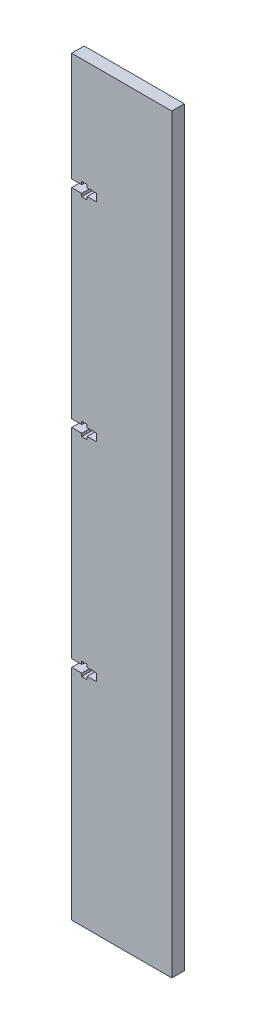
ISO-10303-21;
HEADER;
FILE_DESCRIPTION(('STEP AP214'),'2;1');
FILE_NAME('part.step','',(''),(''),'','','');
FILE_SCHEMA(('AUTOMOTIVE_DESIGN { 1 0 10303 214 1 1 1 1 }'));
ENDSEC;
DATA;
#1=APPLICATION_CONTEXT('core data for automotive mechanical design processes');
#2=APPLICATION_PROTOCOL_DEFINITION('international standard','automotive_design',2000,#1);
#3=PRODUCT_CONTEXT('',#1,'mechanical');
#4=PRODUCT('Part','Part','',(#3));
#5=PRODUCT_RELATED_PRODUCT_CATEGORY('part','',(#4));
#6=PRODUCT_DEFINITION_FORMATION('','',#4);
#7=PRODUCT_DEFINITION_CONTEXT('part definition',#1,'design');
#8=PRODUCT_DEFINITION('design','',#6,#7);
#9=PRODUCT_DEFINITION_SHAPE('','',#8);
#10=(LENGTH_UNIT() NAMED_UNIT(*) SI_UNIT(.MILLI.,.METRE.));
#11=(NAMED_UNIT(*) PLANE_ANGLE_UNIT() SI_UNIT($,.RADIAN.));
#12=(NAMED_UNIT(*) SI_UNIT($,.STERADIAN.) SOLID_ANGLE_UNIT());
#13=UNCERTAINTY_MEASURE_WITH_UNIT(LENGTH_MEASURE(1.E-05),#10,'distance_accuracy_value','');
#14=(GEOMETRIC_REPRESENTATION_CONTEXT(3) GLOBAL_UNCERTAINTY_ASSIGNED_CONTEXT((#13)) GLOBAL_UNIT_ASSIGNED_CONTEXT((#10,
#11,#12)) REPRESENTATION_CONTEXT('',''));
#15=CARTESIAN_POINT('',(0.,0.,0.));
#16=DIRECTION('',(0.,0.,1.));
#17=DIRECTION('',(1.,0.,0.));
#18=AXIS2_PLACEMENT_3D('',#15,#16,#17);
#19=CARTESIAN_POINT('',(-20.,150.,5.));
#20=DIRECTION('',(1.,0.,0.));
#21=DIRECTION('',(0.,1.,0.));
#22=AXIS2_PLACEMENT_3D('',#19,#20,#21);
#23=PLANE('',#22);
#24=DIRECTION('',(0.,-1.,0.));
#25=VECTOR('',#24,1.);
#26=CARTESIAN_POINT('',(-20.,150.,0.));
#27=LINE('',#26,#25);
#28=CARTESIAN_POINT('',(-20.,103.499999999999,0.));
#29=VERTEX_POINT('',#28);
#30=CARTESIAN_POINT('',(-20.,23.4999999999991,0.));
#31=VERTEX_POINT('',#30);
#32=EDGE_CURVE('E316',#29,#31,#27,.T.);
#33=ORIENTED_EDGE('',*,*,#32,.T.);
#34=DIRECTION('',(0.,0.,-1.));
#35=VECTOR('',#34,1.);
#36=CARTESIAN_POINT('',(-20.,23.4999999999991,10.));
#37=LINE('',#36,#35);
#38=CARTESIAN_POINT('',(-20.,23.4999999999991,5.));
#39=VERTEX_POINT('',#38);
#40=EDGE_CURVE('E308',#39,#31,#37,.T.);
#41=ORIENTED_EDGE('',*,*,#40,.F.);
#42=DIRECTION('',(0.,-1.,0.));
#43=VECTOR('',#42,1.);
#44=CARTESIAN_POINT('',(-20.,150.,5.));
#45=LINE('',#44,#43);
#46=CARTESIAN_POINT('',(-20.,103.499999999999,5.));
#47=VERTEX_POINT('',#46);
#48=EDGE_CURVE('E539',#47,#39,#45,.T.);
#49=ORIENTED_EDGE('',*,*,#48,.F.);
#50=DIRECTION('',(0.,0.,-1.));
#51=VECTOR('',#50,1.);
#52=CARTESIAN_POINT('',(-20.,103.499999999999,10.));
#53=LINE('',#52,#51);
#54=EDGE_CURVE('E408',#47,#29,#53,.T.);
#55=ORIENTED_EDGE('',*,*,#54,.T.);
#56=EDGE_LOOP('',(#33,#41,#49,#55));
#57=FACE_BOUND('',#56,.T.);
#58=ADVANCED_FACE('F33',(#57),#23,.F.);
#59=CARTESIAN_POINT('',(-20.,150.,0.));
#60=VERTEX_POINT('',#59);
#61=CARTESIAN_POINT('',(-20.,106.499999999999,0.));
#62=VERTEX_POINT('',#61);
#63=EDGE_CURVE('E319',#60,#62,#27,.T.);
#64=ORIENTED_EDGE('',*,*,#63,.T.);
#65=DIRECTION('',(0.,0.,-1.));
#66=VECTOR('',#65,1.);
#67=CARTESIAN_POINT('',(-20.,106.499999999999,10.));
#68=LINE('',#67,#66);
#69=CARTESIAN_POINT('',(-20.,106.499999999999,5.));
#70=VERTEX_POINT('',#69);
#71=EDGE_CURVE('E406',#70,#62,#68,.T.);
#72=ORIENTED_EDGE('',*,*,#71,.F.);
#73=CARTESIAN_POINT('',(-20.,150.,5.));
#74=VERTEX_POINT('',#73);
#75=EDGE_CURVE('E348',#74,#70,#45,.T.);
#76=ORIENTED_EDGE('',*,*,#75,.F.);
#77=DIRECTION('',(0.,0.,-1.));
#78=VECTOR('',#77,1.);
#79=CARTESIAN_POINT('',(-20.,150.,5.));
#80=LINE('',#79,#78);
#81=EDGE_CURVE('E41',#74,#60,#80,.T.);
#82=ORIENTED_EDGE('',*,*,#81,.T.);
#83=EDGE_LOOP('',(#64,#72,#76,#82));
#84=FACE_BOUND('',#83,.T.);
#85=ADVANCED_FACE('F346',(#84),#23,.F.);
#86=CARTESIAN_POINT('',(-20.,20.5000000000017,5.));
#87=VERTEX_POINT('',#86);
#88=CARTESIAN_POINT('',(-20.,-59.4999999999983,5.));
#89=VERTEX_POINT('',#88);
#90=EDGE_CURVE('E307',#87,#89,#45,.T.);
#91=ORIENTED_EDGE('',*,*,#90,.F.);
#92=DIRECTION('',(0.,0.,-1.));
#93=VECTOR('',#92,1.);
#94=CARTESIAN_POINT('',(-20.,20.5000000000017,10.));
#95=LINE('',#94,#93);
#96=CARTESIAN_POINT('',(-20.,20.5000000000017,0.));
#97=VERTEX_POINT('',#96);
#98=EDGE_CURVE('E294',#87,#97,#95,.T.);
#99=ORIENTED_EDGE('',*,*,#98,.T.);
#100=CARTESIAN_POINT('',(-20.,-59.4999999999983,0.));
#101=VERTEX_POINT('',#100);
#102=EDGE_CURVE('E305',#97,#101,#27,.T.);
#103=ORIENTED_EDGE('',*,*,#102,.T.);
#104=DIRECTION('',(0.,0.,-1.));
#105=VECTOR('',#104,1.);
#106=CARTESIAN_POINT('',(-20.,-59.4999999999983,10.));
#107=LINE('',#106,#105);
#108=EDGE_CURVE('E506',#89,#101,#107,.T.);
#109=ORIENTED_EDGE('',*,*,#108,.F.);
#110=EDGE_LOOP('',(#91,#99,#103,#109));
#111=FACE_BOUND('',#110,.T.);
#112=ADVANCED_FACE('F303',(#111),#23,.F.);
#113=CARTESIAN_POINT('',(20.,150.,5.));
#114=DIRECTION('',(-1.,0.,0.));
#115=DIRECTION('',(0.,-1.,0.));
#116=AXIS2_PLACEMENT_3D('',#113,#114,#115);
#117=PLANE('',#116);
#118=DIRECTION('',(0.,1.,0.));
#119=VECTOR('',#118,1.);
#120=CARTESIAN_POINT('',(20.,150.,0.));
#121=LINE('',#120,#119);
#122=CARTESIAN_POINT('',(20.,-150.,0.));
#123=VERTEX_POINT('',#122);
#124=CARTESIAN_POINT('',(20.,150.,0.));
#125=VERTEX_POINT('',#124);
#126=EDGE_CURVE('E534',#123,#125,#121,.T.);
#127=ORIENTED_EDGE('',*,*,#126,.T.);
#128=DIRECTION('',(0.,0.,-1.));
#129=VECTOR('',#128,1.);
#130=CARTESIAN_POINT('',(20.,150.,5.));
#131=LINE('',#130,#129);
#132=CARTESIAN_POINT('',(20.,150.,5.));
#133=VERTEX_POINT('',#132);
#134=EDGE_CURVE('E11',#133,#125,#131,.T.);
#135=ORIENTED_EDGE('',*,*,#134,.F.);
#136=DIRECTION('',(0.,1.,0.));
#137=VECTOR('',#136,1.);
#138=CARTESIAN_POINT('',(20.,150.,5.));
#139=LINE('',#138,#137);
#140=CARTESIAN_POINT('',(20.,-150.,5.));
#141=VERTEX_POINT('',#140);
#142=EDGE_CURVE('E330',#141,#133,#139,.T.);
#143=ORIENTED_EDGE('',*,*,#142,.F.);
#144=DIRECTION('',(0.,0.,-1.));
#145=VECTOR('',#144,1.);
#146=CARTESIAN_POINT('',(20.,-150.,5.));
#147=LINE('',#146,#145);
#148=EDGE_CURVE('E340',#141,#123,#147,.T.);
#149=ORIENTED_EDGE('',*,*,#148,.T.);
#150=EDGE_LOOP('',(#127,#135,#143,#149));
#151=FACE_BOUND('',#150,.T.);
#152=ADVANCED_FACE('F35',(#151),#117,.F.);
#153=CARTESIAN_POINT('',(-20.,150.,5.));
#154=DIRECTION('',(0.,-1.,0.));
#155=DIRECTION('',(0.,0.,-1.));
#156=AXIS2_PLACEMENT_3D('',#153,#154,#155);
#157=PLANE('',#156);
#158=DIRECTION('',(-1.,0.,0.));
#159=VECTOR('',#158,1.);
#160=CARTESIAN_POINT('',(-20.,150.,0.));
#161=LINE('',#160,#159);
#162=EDGE_CURVE('E321',#125,#60,#161,.T.);
#163=ORIENTED_EDGE('',*,*,#162,.T.);
#164=ORIENTED_EDGE('',*,*,#81,.F.);
#165=DIRECTION('',(-1.,0.,0.));
#166=VECTOR('',#165,1.);
#167=CARTESIAN_POINT('',(-20.,150.,5.));
#168=LINE('',#167,#166);
#169=EDGE_CURVE('E337',#133,#74,#168,.T.);
#170=ORIENTED_EDGE('',*,*,#169,.F.);
#171=ORIENTED_EDGE('',*,*,#134,.T.);
#172=EDGE_LOOP('',(#163,#164,#170,#171));
#173=FACE_BOUND('',#172,.T.);
#174=ADVANCED_FACE('F542',(#173),#157,.F.);
#175=CARTESIAN_POINT('',(-20.,-62.4999999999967,5.));
#176=VERTEX_POINT('',#175);
#177=CARTESIAN_POINT('',(-20.,-150.,5.));
#178=VERTEX_POINT('',#177);
#179=EDGE_CURVE('E537',#176,#178,#45,.T.);
#180=ORIENTED_EDGE('',*,*,#179,.F.);
#181=DIRECTION('',(0.,0.,-1.));
#182=VECTOR('',#181,1.);
#183=CARTESIAN_POINT('',(-20.,-62.4999999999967,10.));
#184=LINE('',#183,#182);
#185=CARTESIAN_POINT('',(-20.,-62.4999999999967,0.));
#186=VERTEX_POINT('',#185);
#187=EDGE_CURVE('E508',#176,#186,#184,.T.);
#188=ORIENTED_EDGE('',*,*,#187,.T.);
#189=CARTESIAN_POINT('',(-20.,-150.,0.));
#190=VERTEX_POINT('',#189);
#191=EDGE_CURVE('E317',#186,#190,#27,.T.);
#192=ORIENTED_EDGE('',*,*,#191,.T.);
#193=DIRECTION('',(0.,0.,-1.));
#194=VECTOR('',#193,1.);
#195=CARTESIAN_POINT('',(-20.,-150.,5.));
#196=LINE('',#195,#194);
#197=EDGE_CURVE('E342',#178,#190,#196,.T.);
#198=ORIENTED_EDGE('',*,*,#197,.F.);
#199=EDGE_LOOP('',(#180,#188,#192,#198));
#200=FACE_BOUND('',#199,.T.);
#201=ADVANCED_FACE('F552',(#200),#23,.F.);
#202=CARTESIAN_POINT('',(-20.,-150.,5.));
#203=DIRECTION('',(0.,1.,0.));
#204=DIRECTION('',(0.,0.,1.));
#205=AXIS2_PLACEMENT_3D('',#202,#203,#204);
#206=PLANE('',#205);
#207=DIRECTION('',(1.,0.,0.));
#208=VECTOR('',#207,1.);
#209=CARTESIAN_POINT('',(-20.,-150.,0.));
#210=LINE('',#209,#208);
#211=EDGE_CURVE('E325',#190,#123,#210,.T.);
#212=ORIENTED_EDGE('',*,*,#211,.T.);
#213=ORIENTED_EDGE('',*,*,#148,.F.);
#214=DIRECTION('',(1.,0.,0.));
#215=VECTOR('',#214,1.);
#216=CARTESIAN_POINT('',(-20.,-150.,5.));
#217=LINE('',#216,#215);
#218=EDGE_CURVE('E343',#178,#141,#217,.T.);
#219=ORIENTED_EDGE('',*,*,#218,.F.);
#220=ORIENTED_EDGE('',*,*,#197,.T.);
#221=EDGE_LOOP('',(#212,#213,#219,#220));
#222=FACE_BOUND('',#221,.T.);
#223=ADVANCED_FACE('F554',(#222),#206,.F.);
#224=CARTESIAN_POINT('',(0.,0.,5.));
#225=DIRECTION('',(0.,0.,1.));
#226=DIRECTION('',(1.,0.,0.));
#227=AXIS2_PLACEMENT_3D('',#224,#225,#226);
#228=PLANE('',#227);
#229=DIRECTION('',(-1.,0.,0.));
#230=VECTOR('',#229,1.);
#231=CARTESIAN_POINT('',(0.,23.4999999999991,5.));
#232=LINE('',#231,#230);
#233=CARTESIAN_POINT('',(-15.9999999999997,23.4999999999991,5.));
#234=VERTEX_POINT('',#233);
#235=EDGE_CURVE('E437',#234,#39,#232,.T.);
#236=ORIENTED_EDGE('',*,*,#235,.F.);
#237=DIRECTION('',(3.07724860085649E-13,-1.,0.));
#238=VECTOR('',#237,1.);
#239=CARTESIAN_POINT('',(-15.9999999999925,-4.92359776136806E-12,5.));
#240=LINE('',#239,#238);
#241=CARTESIAN_POINT('',(-16.,24.6500000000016,5.));
#242=VERTEX_POINT('',#241);
#243=EDGE_CURVE('E439',#242,#234,#240,.T.);
#244=ORIENTED_EDGE('',*,*,#243,.F.);
#245=DIRECTION('',(-1.,0.,0.));
#246=VECTOR('',#245,1.);
#247=CARTESIAN_POINT('',(1.16620728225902E-13,24.6500000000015,5.));
#248=LINE('',#247,#246);
#249=CARTESIAN_POINT('',(-13.8,24.6500000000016,5.));
#250=VERTEX_POINT('',#249);
#251=EDGE_CURVE('E441',#250,#242,#248,.T.);
#252=ORIENTED_EDGE('',*,*,#251,.F.);
#253=DIRECTION('',(-3.06216404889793E-13,1.,0.));
#254=VECTOR('',#253,1.);
#255=CARTESIAN_POINT('',(-13.7999999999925,-4.22578638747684E-12,5.));
#256=LINE('',#255,#254);
#257=CARTESIAN_POINT('',(-13.7999999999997,23.5000000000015,5.));
#258=VERTEX_POINT('',#257);
#259=EDGE_CURVE('E443',#258,#250,#256,.T.);
#260=ORIENTED_EDGE('',*,*,#259,.F.);
#261=DIRECTION('',(-1.,0.,0.));
#262=VECTOR('',#261,1.);
#263=CARTESIAN_POINT('',(0.,23.5000000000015,5.));
#264=LINE('',#263,#262);
#265=CARTESIAN_POINT('',(-9.99999999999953,23.5000000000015,5.));
#266=VERTEX_POINT('',#265);
#267=EDGE_CURVE('E445',#266,#258,#264,.T.);
#268=ORIENTED_EDGE('',*,*,#267,.F.);
#269=DIRECTION('',(-3.05889572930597E-13,1.,0.));
#270=VECTOR('',#269,1.);
#271=CARTESIAN_POINT('',(-9.99999999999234,-3.05889572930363E-12,5.));
#272=LINE('',#271,#270);
#273=CARTESIAN_POINT('',(-9.99999999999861,20.5000000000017,5.));
#274=VERTEX_POINT('',#273);
#275=EDGE_CURVE('E447',#274,#266,#272,.T.);
#276=ORIENTED_EDGE('',*,*,#275,.F.);
#277=DIRECTION('',(1.,0.,0.));
#278=VECTOR('',#277,1.);
#279=CARTESIAN_POINT('',(0.,20.5000000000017,5.));
#280=LINE('',#279,#278);
#281=CARTESIAN_POINT('',(-13.7999999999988,20.5000000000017,5.));
#282=VERTEX_POINT('',#281);
#283=EDGE_CURVE('E449',#282,#274,#280,.T.);
#284=ORIENTED_EDGE('',*,*,#283,.F.);
#285=DIRECTION('',(-3.06216404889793E-13,1.,0.));
#286=VECTOR('',#285,1.);
#287=CARTESIAN_POINT('',(-13.7999999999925,-4.22578638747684E-12,5.));
#288=LINE('',#287,#286);
#289=CARTESIAN_POINT('',(-13.7999999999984,19.3500000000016,5.));
#290=VERTEX_POINT('',#289);
#291=EDGE_CURVE('E451',#290,#282,#288,.T.);
#292=ORIENTED_EDGE('',*,*,#291,.F.);
#293=DIRECTION('',(1.,0.,0.));
#294=VECTOR('',#293,1.);
#295=CARTESIAN_POINT('',(0.,19.3500000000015,5.));
#296=LINE('',#295,#294);
#297=CARTESIAN_POINT('',(-15.9999999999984,19.3500000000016,5.));
#298=VERTEX_POINT('',#297);
#299=EDGE_CURVE('E453',#298,#290,#296,.T.);
#300=ORIENTED_EDGE('',*,*,#299,.F.);
#301=DIRECTION('',(3.04707949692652E-13,-1.,0.));
#302=VECTOR('',#301,1.);
#303=CARTESIAN_POINT('',(-15.9999999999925,-4.87532719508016E-12,5.));
#304=LINE('',#303,#302);
#305=CARTESIAN_POINT('',(-15.9999999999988,20.5000000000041,5.));
#306=VERTEX_POINT('',#305);
#307=EDGE_CURVE('E455',#306,#298,#304,.T.);
#308=ORIENTED_EDGE('',*,*,#307,.F.);
#309=DIRECTION('',(1.,1.20650017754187E-12,0.));
#310=VECTOR('',#309,1.);
#311=CARTESIAN_POINT('',(-2.47332536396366E-11,20.5000000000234,5.));
#312=LINE('',#311,#310);
#313=EDGE_CURVE('E435',#87,#306,#312,.T.);
#314=ORIENTED_EDGE('',*,*,#313,.F.);
#315=ORIENTED_EDGE('',*,*,#90,.T.);
#316=DIRECTION('',(-1.,-1.20736753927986E-12,0.));
#317=VECTOR('',#316,1.);
#318=CARTESIAN_POINT('',(7.18383685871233E-11,-59.4999999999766,5.));
#319=LINE('',#318,#317);
#320=CARTESIAN_POINT('',(-15.9999999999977,-59.4999999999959,5.));
#321=VERTEX_POINT('',#320);
#322=EDGE_CURVE('E514',#321,#89,#319,.T.);
#323=ORIENTED_EDGE('',*,*,#322,.F.);
#324=DIRECTION('',(8.59819462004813E-13,-1.,0.));
#325=VECTOR('',#324,1.);
#326=CARTESIAN_POINT('',(-16.0000000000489,-1.3757111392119E-11,5.));
#327=LINE('',#326,#325);
#328=CARTESIAN_POINT('',(-15.9999999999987,-58.3499999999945,5.));
#329=VERTEX_POINT('',#328);
#330=EDGE_CURVE('E517',#329,#321,#327,.T.);
#331=ORIENTED_EDGE('',*,*,#330,.F.);
#332=DIRECTION('',(-1.,-8.38975353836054E-13,0.));
#333=VECTOR('',#332,1.);
#334=CARTESIAN_POINT('',(4.89542118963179E-11,-58.349999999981,5.));
#335=LINE('',#334,#333);
#336=CARTESIAN_POINT('',(-13.7999999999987,-58.3499999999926,5.));
#337=VERTEX_POINT('',#336);
#338=EDGE_CURVE('E519',#337,#329,#335,.T.);
#339=ORIENTED_EDGE('',*,*,#338,.F.);
#340=DIRECTION('',(-8.5680255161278E-13,1.,0.));
#341=VECTOR('',#340,1.);
#342=CARTESIAN_POINT('',(-13.8000000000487,-1.18238752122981E-11,5.));
#343=LINE('',#342,#341);
#344=CARTESIAN_POINT('',(-13.7999999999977,-59.4999999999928,5.));
#345=VERTEX_POINT('',#344);
#346=EDGE_CURVE('E521',#345,#337,#343,.T.);
#347=ORIENTED_EDGE('',*,*,#346,.F.);
#348=DIRECTION('',(-1.,0.,0.));
#349=VECTOR('',#348,1.);
#350=CARTESIAN_POINT('',(-4.34593881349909E-13,-59.4999999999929,5.));
#351=LINE('',#350,#349);
#352=CARTESIAN_POINT('',(-9.99999999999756,-59.4999999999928,5.));
#353=VERTEX_POINT('',#352);
#354=EDGE_CURVE('E523',#353,#345,#351,.T.);
#355=ORIENTED_EDGE('',*,*,#354,.F.);
#356=DIRECTION('',(-8.57531638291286E-13,1.,0.));
#357=VECTOR('',#356,1.);
#358=CARTESIAN_POINT('',(-10.0000000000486,-8.57531638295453E-12,5.));
#359=LINE('',#358,#357);
#360=CARTESIAN_POINT('',(-9.99999999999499,-62.4999999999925,5.));
#361=VERTEX_POINT('',#360);
#362=EDGE_CURVE('E525',#361,#353,#359,.T.);
#363=ORIENTED_EDGE('',*,*,#362,.F.);
#364=DIRECTION('',(1.,0.,0.));
#365=VECTOR('',#364,1.);
#366=CARTESIAN_POINT('',(-4.5650617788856E-13,-62.4999999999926,5.));
#367=LINE('',#366,#365);
#368=CARTESIAN_POINT('',(-13.7999999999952,-62.4999999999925,5.));
#369=VERTEX_POINT('',#368);
#370=EDGE_CURVE('E527',#369,#361,#367,.T.);
#371=ORIENTED_EDGE('',*,*,#370,.F.);
#372=DIRECTION('',(-8.5680255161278E-13,1.,0.));
#373=VECTOR('',#372,1.);
#374=CARTESIAN_POINT('',(-13.8000000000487,-1.18238752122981E-11,5.));
#375=LINE('',#374,#373);
#376=CARTESIAN_POINT('',(-13.7999999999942,-63.6499999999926,5.));
#377=VERTEX_POINT('',#376);
#378=EDGE_CURVE('E529',#377,#369,#375,.T.);
#379=ORIENTED_EDGE('',*,*,#378,.F.);
#380=DIRECTION('',(1.,8.38975353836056E-13,0.));
#381=VECTOR('',#380,1.);
#382=CARTESIAN_POINT('',(5.34007812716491E-11,-63.649999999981,5.));
#383=LINE('',#382,#381);
#384=CARTESIAN_POINT('',(-15.9999999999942,-63.6499999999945,5.));
#385=VERTEX_POINT('',#384);
#386=EDGE_CURVE('E531',#385,#377,#383,.T.);
#387=ORIENTED_EDGE('',*,*,#386,.F.);
#388=DIRECTION('',(8.56802551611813E-13,-1.,0.));
#389=VECTOR('',#388,1.);
#390=CARTESIAN_POINT('',(-16.0000000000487,-1.37088408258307E-11,5.));
#391=LINE('',#390,#389);
#392=CARTESIAN_POINT('',(-15.9999999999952,-62.499999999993,5.));
#393=VERTEX_POINT('',#392);
#394=EDGE_CURVE('E533',#393,#385,#391,.T.);
#395=ORIENTED_EDGE('',*,*,#394,.F.);
#396=DIRECTION('',(1.,1.85788884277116E-12,0.));
#397=VECTOR('',#396,1.);
#398=CARTESIAN_POINT('',(1.16118052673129E-10,-62.4999999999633,5.));
#399=LINE('',#398,#397);
#400=EDGE_CURVE('E489',#176,#393,#399,.T.);
#401=ORIENTED_EDGE('',*,*,#400,.F.);
#402=ORIENTED_EDGE('',*,*,#179,.T.);
#403=ORIENTED_EDGE('',*,*,#218,.T.);
#404=ORIENTED_EDGE('',*,*,#142,.T.);
#405=ORIENTED_EDGE('',*,*,#169,.T.);
#406=ORIENTED_EDGE('',*,*,#75,.T.);
#407=DIRECTION('',(-1.,3.95516952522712E-13,0.));
#408=VECTOR('',#407,1.);
#409=CARTESIAN_POINT('',(4.21225554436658E-11,106.499999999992,5.));
#410=LINE('',#409,#408);
#411=CARTESIAN_POINT('',(-16.0000000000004,106.499999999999,5.));
#412=VERTEX_POINT('',#411);
#413=EDGE_CURVE('E414',#412,#70,#410,.T.);
#414=ORIENTED_EDGE('',*,*,#413,.F.);
#415=DIRECTION('',(0.,-1.,0.));
#416=VECTOR('',#415,1.);
#417=CARTESIAN_POINT('',(-16.000000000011,1.59292868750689E-12,5.));
#418=LINE('',#417,#416);
#419=CARTESIAN_POINT('',(-16.0000000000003,107.649999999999,5.));
#420=VERTEX_POINT('',#419);
#421=EDGE_CURVE('E417',#420,#412,#418,.T.);
#422=ORIENTED_EDGE('',*,*,#421,.F.);
#423=DIRECTION('',(-1.,2.01858731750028E-13,0.));
#424=VECTOR('',#423,1.);
#425=CARTESIAN_POINT('',(2.17300924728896E-11,107.649999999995,5.));
#426=LINE('',#425,#424);
#427=CARTESIAN_POINT('',(-13.8000000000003,107.649999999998,5.));
#428=VERTEX_POINT('',#427);
#429=EDGE_CURVE('E419',#428,#420,#426,.T.);
#430=ORIENTED_EDGE('',*,*,#429,.F.);
#431=DIRECTION('',(0.,1.,0.));
#432=VECTOR('',#431,1.);
#433=CARTESIAN_POINT('',(-13.7999999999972,-3.95516952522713E-13,5.));
#434=LINE('',#433,#432);
#435=CARTESIAN_POINT('',(-13.8000000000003,106.499999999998,5.));
#436=VERTEX_POINT('',#435);
#437=EDGE_CURVE('E421',#436,#428,#434,.T.);
#438=ORIENTED_EDGE('',*,*,#437,.F.);
#439=DIRECTION('',(-1.,1.97210668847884E-13,0.));
#440=VECTOR('',#439,1.);
#441=CARTESIAN_POINT('',(2.10029362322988E-11,106.499999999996,5.));
#442=LINE('',#441,#440);
#443=CARTESIAN_POINT('',(-10.0000000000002,106.499999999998,5.));
#444=VERTEX_POINT('',#443);
#445=EDGE_CURVE('E423',#444,#436,#442,.T.);
#446=ORIENTED_EDGE('',*,*,#445,.F.);
#447=DIRECTION('',(0.,1.,0.));
#448=VECTOR('',#447,1.);
#449=CARTESIAN_POINT('',(-10.0000000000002,0.,5.));
#450=LINE('',#449,#448);
#451=CARTESIAN_POINT('',(-10.0000000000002,103.499999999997,5.));
#452=VERTEX_POINT('',#451);
#453=EDGE_CURVE('E425',#452,#444,#450,.T.);
#454=ORIENTED_EDGE('',*,*,#453,.F.);
#455=DIRECTION('',(1.,-1.97210668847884E-13,0.));
#456=VECTOR('',#455,1.);
#457=CARTESIAN_POINT('',(2.04113042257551E-11,103.499999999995,5.));
#458=LINE('',#457,#456);
#459=CARTESIAN_POINT('',(-13.8000000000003,103.499999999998,5.));
#460=VERTEX_POINT('',#459);
#461=EDGE_CURVE('E427',#460,#452,#458,.T.);
#462=ORIENTED_EDGE('',*,*,#461,.F.);
#463=DIRECTION('',(0.,1.,0.));
#464=VECTOR('',#463,1.);
#465=CARTESIAN_POINT('',(-13.8000000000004,0.,5.));
#466=LINE('',#465,#464);
#467=CARTESIAN_POINT('',(-13.8000000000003,102.349999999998,5.));
#468=VERTEX_POINT('',#467);
#469=EDGE_CURVE('E429',#468,#460,#466,.T.);
#470=ORIENTED_EDGE('',*,*,#469,.F.);
#471=DIRECTION('',(1.,-2.01858731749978E-13,0.));
#472=VECTOR('',#471,1.);
#473=CARTESIAN_POINT('',(2.06602411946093E-11,102.349999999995,5.));
#474=LINE('',#473,#472);
#475=CARTESIAN_POINT('',(-16.0000000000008,102.349999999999,5.));
#476=VERTEX_POINT('',#475);
#477=EDGE_CURVE('E431',#476,#468,#474,.T.);
#478=ORIENTED_EDGE('',*,*,#477,.F.);
#479=DIRECTION('',(0.,-1.,0.));
#480=VECTOR('',#479,1.);
#481=CARTESIAN_POINT('',(-16.0000000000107,1.54465812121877E-12,5.));
#482=LINE('',#481,#480);
#483=CARTESIAN_POINT('',(-16.0000000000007,103.499999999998,5.));
#484=VERTEX_POINT('',#483);
#485=EDGE_CURVE('E433',#484,#476,#482,.T.);
#486=ORIENTED_EDGE('',*,*,#485,.F.);
#487=DIRECTION('',(1.,-3.26128013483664E-13,0.));
#488=VECTOR('',#487,1.);
#489=CARTESIAN_POINT('',(3.3754249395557E-11,103.499999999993,5.));
#490=LINE('',#489,#488);
#491=EDGE_CURVE('E412',#47,#484,#490,.T.);
#492=ORIENTED_EDGE('',*,*,#491,.F.);
#493=ORIENTED_EDGE('',*,*,#48,.T.);
#494=EDGE_LOOP('',(#236,#244,#252,#260,#268,#276,#284,#292,#300,#308,#314,#315,#323,#331,#339,
#347,#355,#363,#371,#379,#387,#395,#401,#402,#403,#404,#405,#406,#414,#422,#430,#438,#446,#454,
#462,#470,#478,#486,#492,#493));
#495=FACE_BOUND('',#494,.T.);
#496=ADVANCED_FACE('F557',(#495),#228,.T.);
#497=CARTESIAN_POINT('',(0.,0.,0.));
#498=DIRECTION('',(0.,0.,1.));
#499=DIRECTION('',(1.,0.,0.));
#500=AXIS2_PLACEMENT_3D('',#497,#498,#499);
#501=PLANE('',#500);
#502=DIRECTION('',(-3.07724860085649E-13,1.,0.));
#503=VECTOR('',#502,1.);
#504=CARTESIAN_POINT('',(-15.9999999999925,-4.92359776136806E-12,0.));
#505=LINE('',#504,#503);
#506=CARTESIAN_POINT('',(-15.9999999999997,23.4999999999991,0.));
#507=VERTEX_POINT('',#506);
#508=CARTESIAN_POINT('',(-16.,24.6500000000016,0.));
#509=VERTEX_POINT('',#508);
#510=EDGE_CURVE('E612',#507,#509,#505,.T.);
#511=ORIENTED_EDGE('',*,*,#510,.F.);
#512=DIRECTION('',(1.,0.,0.));
#513=VECTOR('',#512,1.);
#514=CARTESIAN_POINT('',(0.,23.4999999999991,0.));
#515=LINE('',#514,#513);
#516=EDGE_CURVE('E299',#31,#507,#515,.T.);
#517=ORIENTED_EDGE('',*,*,#516,.F.);
#518=ORIENTED_EDGE('',*,*,#32,.F.);
#519=DIRECTION('',(-1.,3.26128013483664E-13,0.));
#520=VECTOR('',#519,1.);
#521=CARTESIAN_POINT('',(3.3754249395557E-11,103.499999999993,0.));
#522=LINE('',#521,#520);
#523=CARTESIAN_POINT('',(-16.0000000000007,103.499999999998,0.));
#524=VERTEX_POINT('',#523);
#525=EDGE_CURVE('E360',#524,#29,#522,.T.);
#526=ORIENTED_EDGE('',*,*,#525,.F.);
#527=DIRECTION('',(0.,1.,0.));
#528=VECTOR('',#527,1.);
#529=CARTESIAN_POINT('',(-16.0000000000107,1.54465812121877E-12,0.));
#530=LINE('',#529,#528);
#531=CARTESIAN_POINT('',(-16.0000000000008,102.349999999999,0.));
#532=VERTEX_POINT('',#531);
#533=EDGE_CURVE('E56',#532,#524,#530,.T.);
#534=ORIENTED_EDGE('',*,*,#533,.F.);
#535=DIRECTION('',(-1.,2.01858731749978E-13,0.));
#536=VECTOR('',#535,1.);
#537=CARTESIAN_POINT('',(2.06602411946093E-11,102.349999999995,0.));
#538=LINE('',#537,#536);
#539=CARTESIAN_POINT('',(-13.8000000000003,102.349999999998,0.));
#540=VERTEX_POINT('',#539);
#541=EDGE_CURVE('E384',#540,#532,#538,.T.);
#542=ORIENTED_EDGE('',*,*,#541,.F.);
#543=DIRECTION('',(0.,-1.,0.));
#544=VECTOR('',#543,1.);
#545=CARTESIAN_POINT('',(-13.8000000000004,0.,0.));
#546=LINE('',#545,#544);
#547=CARTESIAN_POINT('',(-13.8000000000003,103.499999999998,0.));
#548=VERTEX_POINT('',#547);
#549=EDGE_CURVE('E381',#548,#540,#546,.T.);
#550=ORIENTED_EDGE('',*,*,#549,.F.);
#551=DIRECTION('',(-1.,1.97210668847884E-13,0.));
#552=VECTOR('',#551,1.);
#553=CARTESIAN_POINT('',(2.04113042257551E-11,103.499999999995,0.));
#554=LINE('',#553,#552);
#555=CARTESIAN_POINT('',(-10.0000000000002,103.499999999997,0.));
#556=VERTEX_POINT('',#555);
#557=EDGE_CURVE('E378',#556,#548,#554,.T.);
#558=ORIENTED_EDGE('',*,*,#557,.F.);
#559=DIRECTION('',(0.,-1.,0.));
#560=VECTOR('',#559,1.);
#561=CARTESIAN_POINT('',(-10.0000000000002,0.,0.));
#562=LINE('',#561,#560);
#563=CARTESIAN_POINT('',(-10.0000000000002,106.499999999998,0.));
#564=VERTEX_POINT('',#563);
#565=EDGE_CURVE('E375',#564,#556,#562,.T.);
#566=ORIENTED_EDGE('',*,*,#565,.F.);
#567=DIRECTION('',(1.,-1.97210668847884E-13,0.));
#568=VECTOR('',#567,1.);
#569=CARTESIAN_POINT('',(2.10029362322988E-11,106.499999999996,0.));
#570=LINE('',#569,#568);
#571=CARTESIAN_POINT('',(-13.8000000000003,106.499999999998,0.));
#572=VERTEX_POINT('',#571);
#573=EDGE_CURVE('E372',#572,#564,#570,.T.);
#574=ORIENTED_EDGE('',*,*,#573,.F.);
#575=DIRECTION('',(0.,-1.,0.));
#576=VECTOR('',#575,1.);
#577=CARTESIAN_POINT('',(-13.7999999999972,-3.95516952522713E-13,0.));
#578=LINE('',#577,#576);
#579=CARTESIAN_POINT('',(-13.8000000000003,107.649999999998,0.));
#580=VERTEX_POINT('',#579);
#581=EDGE_CURVE('E369',#580,#572,#578,.T.);
#582=ORIENTED_EDGE('',*,*,#581,.F.);
#583=DIRECTION('',(1.,-2.01858731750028E-13,0.));
#584=VECTOR('',#583,1.);
#585=CARTESIAN_POINT('',(2.17300924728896E-11,107.649999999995,0.));
#586=LINE('',#585,#584);
#587=CARTESIAN_POINT('',(-16.0000000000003,107.649999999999,0.));
#588=VERTEX_POINT('',#587);
#589=EDGE_CURVE('E362',#588,#580,#586,.T.);
#590=ORIENTED_EDGE('',*,*,#589,.F.);
#591=DIRECTION('',(0.,1.,0.));
#592=VECTOR('',#591,1.);
#593=CARTESIAN_POINT('',(-16.000000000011,1.59292868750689E-12,0.));
#594=LINE('',#593,#592);
#595=CARTESIAN_POINT('',(-16.0000000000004,106.499999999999,0.));
#596=VERTEX_POINT('',#595);
#597=EDGE_CURVE('E357',#596,#588,#594,.T.);
#598=ORIENTED_EDGE('',*,*,#597,.F.);
#599=DIRECTION('',(1.,-3.95516952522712E-13,0.));
#600=VECTOR('',#599,1.);
#601=CARTESIAN_POINT('',(4.21225554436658E-11,106.499999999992,0.));
#602=LINE('',#601,#600);
#603=EDGE_CURVE('E354',#62,#596,#602,.T.);
#604=ORIENTED_EDGE('',*,*,#603,.F.);
#605=ORIENTED_EDGE('',*,*,#63,.F.);
#606=ORIENTED_EDGE('',*,*,#162,.F.);
#607=ORIENTED_EDGE('',*,*,#126,.F.);
#608=ORIENTED_EDGE('',*,*,#211,.F.);
#609=ORIENTED_EDGE('',*,*,#191,.F.);
#610=DIRECTION('',(-1.,-1.85788884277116E-12,0.));
#611=VECTOR('',#610,1.);
#612=CARTESIAN_POINT('',(1.16118052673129E-10,-62.4999999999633,0.));
#613=LINE('',#612,#611);
#614=CARTESIAN_POINT('',(-15.9999999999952,-62.499999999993,0.));
#615=VERTEX_POINT('',#614);
#616=EDGE_CURVE('E459',#615,#186,#613,.T.);
#617=ORIENTED_EDGE('',*,*,#616,.F.);
#618=DIRECTION('',(-8.56802551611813E-13,1.,0.));
#619=VECTOR('',#618,1.);
#620=CARTESIAN_POINT('',(-16.0000000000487,-1.37088408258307E-11,0.));
#621=LINE('',#620,#619);
#622=CARTESIAN_POINT('',(-15.9999999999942,-63.6499999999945,0.));
#623=VERTEX_POINT('',#622);
#624=EDGE_CURVE('E457',#623,#615,#621,.T.);
#625=ORIENTED_EDGE('',*,*,#624,.F.);
#626=DIRECTION('',(-1.,-8.38975353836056E-13,0.));
#627=VECTOR('',#626,1.);
#628=CARTESIAN_POINT('',(5.34007812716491E-11,-63.649999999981,0.));
#629=LINE('',#628,#627);
#630=CARTESIAN_POINT('',(-13.7999999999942,-63.6499999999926,0.));
#631=VERTEX_POINT('',#630);
#632=EDGE_CURVE('E483',#631,#623,#629,.T.);
#633=ORIENTED_EDGE('',*,*,#632,.F.);
#634=DIRECTION('',(8.5680255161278E-13,-1.,0.));
#635=VECTOR('',#634,1.);
#636=CARTESIAN_POINT('',(-13.8000000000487,-1.18238752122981E-11,0.));
#637=LINE('',#636,#635);
#638=CARTESIAN_POINT('',(-13.7999999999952,-62.4999999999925,0.));
#639=VERTEX_POINT('',#638);
#640=EDGE_CURVE('E480',#639,#631,#637,.T.);
#641=ORIENTED_EDGE('',*,*,#640,.F.);
#642=DIRECTION('',(-1.,0.,0.));
#643=VECTOR('',#642,1.);
#644=CARTESIAN_POINT('',(-4.5650617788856E-13,-62.4999999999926,0.));
#645=LINE('',#644,#643);
#646=CARTESIAN_POINT('',(-9.99999999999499,-62.4999999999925,0.));
#647=VERTEX_POINT('',#646);
#648=EDGE_CURVE('E477',#647,#639,#645,.T.);
#649=ORIENTED_EDGE('',*,*,#648,.F.);
#650=DIRECTION('',(8.57531638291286E-13,-1.,0.));
#651=VECTOR('',#650,1.);
#652=CARTESIAN_POINT('',(-10.0000000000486,-8.57531638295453E-12,0.));
#653=LINE('',#652,#651);
#654=CARTESIAN_POINT('',(-9.99999999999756,-59.4999999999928,0.));
#655=VERTEX_POINT('',#654);
#656=EDGE_CURVE('E474',#655,#647,#653,.T.);
#657=ORIENTED_EDGE('',*,*,#656,.F.);
#658=DIRECTION('',(1.,0.,0.));
#659=VECTOR('',#658,1.);
#660=CARTESIAN_POINT('',(-4.34593881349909E-13,-59.4999999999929,0.));
#661=LINE('',#660,#659);
#662=CARTESIAN_POINT('',(-13.7999999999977,-59.4999999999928,0.));
#663=VERTEX_POINT('',#662);
#664=EDGE_CURVE('E471',#663,#655,#661,.T.);
#665=ORIENTED_EDGE('',*,*,#664,.F.);
#666=DIRECTION('',(8.5680255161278E-13,-1.,0.));
#667=VECTOR('',#666,1.);
#668=CARTESIAN_POINT('',(-13.8000000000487,-1.18238752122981E-11,0.));
#669=LINE('',#668,#667);
#670=CARTESIAN_POINT('',(-13.7999999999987,-58.3499999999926,0.));
#671=VERTEX_POINT('',#670);
#672=EDGE_CURVE('E468',#671,#663,#669,.T.);
#673=ORIENTED_EDGE('',*,*,#672,.F.);
#674=DIRECTION('',(1.,8.38975353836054E-13,0.));
#675=VECTOR('',#674,1.);
#676=CARTESIAN_POINT('',(4.89542118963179E-11,-58.349999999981,0.));
#677=LINE('',#676,#675);
#678=CARTESIAN_POINT('',(-15.9999999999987,-58.3499999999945,0.));
#679=VERTEX_POINT('',#678);
#680=EDGE_CURVE('E465',#679,#671,#677,.T.);
#681=ORIENTED_EDGE('',*,*,#680,.F.);
#682=DIRECTION('',(-8.59819462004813E-13,1.,0.));
#683=VECTOR('',#682,1.);
#684=CARTESIAN_POINT('',(-16.0000000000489,-1.3757111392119E-11,0.));
#685=LINE('',#684,#683);
#686=CARTESIAN_POINT('',(-15.9999999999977,-59.4999999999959,0.));
#687=VERTEX_POINT('',#686);
#688=EDGE_CURVE('E462',#687,#679,#685,.T.);
#689=ORIENTED_EDGE('',*,*,#688,.F.);
#690=DIRECTION('',(1.,1.20736753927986E-12,0.));
#691=VECTOR('',#690,1.);
#692=CARTESIAN_POINT('',(7.18383685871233E-11,-59.4999999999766,0.));
#693=LINE('',#692,#691);
#694=EDGE_CURVE('E315',#101,#687,#693,.T.);
#695=ORIENTED_EDGE('',*,*,#694,.F.);
#696=ORIENTED_EDGE('',*,*,#102,.F.);
#697=DIRECTION('',(-1.,-1.20650017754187E-12,0.));
#698=VECTOR('',#697,1.);
#699=CARTESIAN_POINT('',(-2.47332536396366E-11,20.5000000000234,0.));
#700=LINE('',#699,#698);
#701=CARTESIAN_POINT('',(-15.9999999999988,20.5000000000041,0.));
#702=VERTEX_POINT('',#701);
#703=EDGE_CURVE('E291',#702,#97,#700,.T.);
#704=ORIENTED_EDGE('',*,*,#703,.F.);
#705=DIRECTION('',(-3.04707949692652E-13,1.,0.));
#706=VECTOR('',#705,1.);
#707=CARTESIAN_POINT('',(-15.9999999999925,-4.87532719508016E-12,0.));
#708=LINE('',#707,#706);
#709=CARTESIAN_POINT('',(-15.9999999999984,19.3500000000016,0.));
#710=VERTEX_POINT('',#709);
#711=EDGE_CURVE('E48',#710,#702,#708,.T.);
#712=ORIENTED_EDGE('',*,*,#711,.F.);
#713=DIRECTION('',(-1.,0.,0.));
#714=VECTOR('',#713,1.);
#715=CARTESIAN_POINT('',(0.,19.3500000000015,0.));
#716=LINE('',#715,#714);
#717=CARTESIAN_POINT('',(-13.7999999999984,19.3500000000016,0.));
#718=VERTEX_POINT('',#717);
#719=EDGE_CURVE('E577',#718,#710,#716,.T.);
#720=ORIENTED_EDGE('',*,*,#719,.F.);
#721=DIRECTION('',(3.06216404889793E-13,-1.,0.));
#722=VECTOR('',#721,1.);
#723=CARTESIAN_POINT('',(-13.7999999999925,-4.22578638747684E-12,0.));
#724=LINE('',#723,#722);
#725=CARTESIAN_POINT('',(-13.7999999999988,20.5000000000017,0.));
#726=VERTEX_POINT('',#725);
#727=EDGE_CURVE('E579',#726,#718,#724,.T.);
#728=ORIENTED_EDGE('',*,*,#727,.F.);
#729=DIRECTION('',(-1.,0.,0.));
#730=VECTOR('',#729,1.);
#731=CARTESIAN_POINT('',(0.,20.5000000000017,0.));
#732=LINE('',#731,#730);
#733=CARTESIAN_POINT('',(-9.99999999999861,20.5000000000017,0.));
#734=VERTEX_POINT('',#733);
#735=EDGE_CURVE('E585',#734,#726,#732,.T.);
#736=ORIENTED_EDGE('',*,*,#735,.F.);
#737=DIRECTION('',(3.05889572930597E-13,-1.,0.));
#738=VECTOR('',#737,1.);
#739=CARTESIAN_POINT('',(-9.99999999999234,-3.05889572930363E-12,0.));
#740=LINE('',#739,#738);
#741=CARTESIAN_POINT('',(-9.99999999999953,23.5000000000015,0.));
#742=VERTEX_POINT('',#741);
#743=EDGE_CURVE('E626',#742,#734,#740,.T.);
#744=ORIENTED_EDGE('',*,*,#743,.F.);
#745=DIRECTION('',(1.,0.,0.));
#746=VECTOR('',#745,1.);
#747=CARTESIAN_POINT('',(0.,23.5000000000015,0.));
#748=LINE('',#747,#746);
#749=CARTESIAN_POINT('',(-13.7999999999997,23.5000000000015,0.));
#750=VERTEX_POINT('',#749);
#751=EDGE_CURVE('E620',#750,#742,#748,.T.);
#752=ORIENTED_EDGE('',*,*,#751,.F.);
#753=DIRECTION('',(3.06216404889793E-13,-1.,0.));
#754=VECTOR('',#753,1.);
#755=CARTESIAN_POINT('',(-13.7999999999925,-4.22578638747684E-12,0.));
#756=LINE('',#755,#754);
#757=CARTESIAN_POINT('',(-13.8,24.6500000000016,0.));
#758=VERTEX_POINT('',#757);
#759=EDGE_CURVE('E618',#758,#750,#756,.T.);
#760=ORIENTED_EDGE('',*,*,#759,.F.);
#761=DIRECTION('',(1.,0.,0.));
#762=VECTOR('',#761,1.);
#763=CARTESIAN_POINT('',(1.16620728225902E-13,24.6500000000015,0.));
#764=LINE('',#763,#762);
#765=EDGE_CURVE('E608',#509,#758,#764,.T.);
#766=ORIENTED_EDGE('',*,*,#765,.F.);
#767=EDGE_LOOP('',(#511,#517,#518,#526,#534,#542,#550,#558,#566,#574,#582,#590,#598,#604,#605,
#606,#607,#608,#609,#617,#625,#633,#641,#649,#657,#665,#673,#681,#689,#695,#696,#704,#712,#720,
#728,#736,#744,#752,#760,#766));
#768=FACE_BOUND('',#767,.T.);
#769=ADVANCED_FACE('F312',(#768),#501,.F.);
#770=CARTESIAN_POINT('',(-16.0000000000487,-1.37088408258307E-11,10.));
#771=DIRECTION('',(-1.,-8.56802551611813E-13,0.));
#772=DIRECTION('',(8.56802551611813E-13,-1.,0.));
#773=AXIS2_PLACEMENT_3D('',#770,#771,#772);
#774=PLANE('',#773);
#775=ORIENTED_EDGE('',*,*,#394,.T.);
#776=DIRECTION('',(0.,0.,-1.));
#777=VECTOR('',#776,1.);
#778=CARTESIAN_POINT('',(-15.9999999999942,-63.6499999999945,10.));
#779=LINE('',#778,#777);
#780=EDGE_CURVE('E487',#385,#623,#779,.T.);
#781=ORIENTED_EDGE('',*,*,#780,.T.);
#782=ORIENTED_EDGE('',*,*,#624,.T.);
#783=DIRECTION('',(0.,0.,-1.));
#784=VECTOR('',#783,1.);
#785=CARTESIAN_POINT('',(-15.9999999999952,-62.499999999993,10.));
#786=LINE('',#785,#784);
#787=EDGE_CURVE('E486',#393,#615,#786,.T.);
#788=ORIENTED_EDGE('',*,*,#787,.F.);
#789=EDGE_LOOP('',(#775,#781,#782,#788));
#790=FACE_BOUND('',#789,.T.);
#791=ADVANCED_FACE('F772',(#790),#774,.F.);
#792=CARTESIAN_POINT('',(5.34007812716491E-11,-63.649999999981,10.));
#793=DIRECTION('',(8.38975353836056E-13,-1.,0.));
#794=DIRECTION('',(1.,8.38975353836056E-13,0.));
#795=AXIS2_PLACEMENT_3D('',#792,#793,#794);
#796=PLANE('',#795);
#797=ORIENTED_EDGE('',*,*,#386,.T.);
#798=DIRECTION('',(0.,0.,-1.));
#799=VECTOR('',#798,1.);
#800=CARTESIAN_POINT('',(-13.7999999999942,-63.6499999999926,10.));
#801=LINE('',#800,#799);
#802=EDGE_CURVE('E490',#377,#631,#801,.T.);
#803=ORIENTED_EDGE('',*,*,#802,.T.);
#804=ORIENTED_EDGE('',*,*,#632,.T.);
#805=ORIENTED_EDGE('',*,*,#780,.F.);
#806=EDGE_LOOP('',(#797,#803,#804,#805));
#807=FACE_BOUND('',#806,.T.);
#808=ADVANCED_FACE('F780',(#807),#796,.F.);
#809=CARTESIAN_POINT('',(-13.8000000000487,-1.18238752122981E-11,10.));
#810=DIRECTION('',(1.,8.5680255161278E-13,0.));
#811=DIRECTION('',(-8.5680255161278E-13,1.,0.));
#812=AXIS2_PLACEMENT_3D('',#809,#810,#811);
#813=PLANE('',#812);
#814=ORIENTED_EDGE('',*,*,#378,.T.);
#815=DIRECTION('',(0.,0.,-1.));
#816=VECTOR('',#815,1.);
#817=CARTESIAN_POINT('',(-13.7999999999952,-62.4999999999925,10.));
#818=LINE('',#817,#816);
#819=EDGE_CURVE('E492',#369,#639,#818,.T.);
#820=ORIENTED_EDGE('',*,*,#819,.T.);
#821=ORIENTED_EDGE('',*,*,#640,.T.);
#822=ORIENTED_EDGE('',*,*,#802,.F.);
#823=EDGE_LOOP('',(#814,#820,#821,#822));
#824=FACE_BOUND('',#823,.T.);
#825=ADVANCED_FACE('F790',(#824),#813,.F.);
#826=CARTESIAN_POINT('',(-4.5650617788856E-13,-62.4999999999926,10.));
#827=DIRECTION('',(0.,-1.,0.));
#828=DIRECTION('',(1.,0.,0.));
#829=AXIS2_PLACEMENT_3D('',#826,#827,#828);
#830=PLANE('',#829);
#831=ORIENTED_EDGE('',*,*,#370,.T.);
#832=DIRECTION('',(0.,0.,-1.));
#833=VECTOR('',#832,1.);
#834=CARTESIAN_POINT('',(-9.99999999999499,-62.4999999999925,10.));
#835=LINE('',#834,#833);
#836=EDGE_CURVE('E494',#361,#647,#835,.T.);
#837=ORIENTED_EDGE('',*,*,#836,.T.);
#838=ORIENTED_EDGE('',*,*,#648,.T.);
#839=ORIENTED_EDGE('',*,*,#819,.F.);
#840=EDGE_LOOP('',(#831,#837,#838,#839));
#841=FACE_BOUND('',#840,.T.);
#842=ADVANCED_FACE('F800',(#841),#830,.F.);
#843=CARTESIAN_POINT('',(-10.0000000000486,-8.57531638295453E-12,10.));
#844=DIRECTION('',(1.,8.57531638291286E-13,0.));
#845=DIRECTION('',(-8.57531638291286E-13,1.,0.));
#846=AXIS2_PLACEMENT_3D('',#843,#844,#845);
#847=PLANE('',#846);
#848=ORIENTED_EDGE('',*,*,#362,.T.);
#849=DIRECTION('',(0.,0.,-1.));
#850=VECTOR('',#849,1.);
#851=CARTESIAN_POINT('',(-9.99999999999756,-59.4999999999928,10.));
#852=LINE('',#851,#850);
#853=EDGE_CURVE('E496',#353,#655,#852,.T.);
#854=ORIENTED_EDGE('',*,*,#853,.T.);
#855=ORIENTED_EDGE('',*,*,#656,.T.);
#856=ORIENTED_EDGE('',*,*,#836,.F.);
#857=EDGE_LOOP('',(#848,#854,#855,#856));
#858=FACE_BOUND('',#857,.T.);
#859=ADVANCED_FACE('F810',(#858),#847,.F.);
#860=CARTESIAN_POINT('',(-4.34593881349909E-13,-59.4999999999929,10.));
#861=DIRECTION('',(0.,1.,0.));
#862=DIRECTION('',(-1.,0.,0.));
#863=AXIS2_PLACEMENT_3D('',#860,#861,#862);
#864=PLANE('',#863);
#865=ORIENTED_EDGE('',*,*,#354,.T.);
#866=DIRECTION('',(0.,0.,-1.));
#867=VECTOR('',#866,1.);
#868=CARTESIAN_POINT('',(-13.7999999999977,-59.4999999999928,10.));
#869=LINE('',#868,#867);
#870=EDGE_CURVE('E498',#345,#663,#869,.T.);
#871=ORIENTED_EDGE('',*,*,#870,.T.);
#872=ORIENTED_EDGE('',*,*,#664,.T.);
#873=ORIENTED_EDGE('',*,*,#853,.F.);
#874=EDGE_LOOP('',(#865,#871,#872,#873));
#875=FACE_BOUND('',#874,.T.);
#876=ADVANCED_FACE('F820',(#875),#864,.F.);
#877=CARTESIAN_POINT('',(-13.8000000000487,-1.18238752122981E-11,10.));
#878=DIRECTION('',(1.,8.5680255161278E-13,0.));
#879=DIRECTION('',(-8.5680255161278E-13,1.,0.));
#880=AXIS2_PLACEMENT_3D('',#877,#878,#879);
#881=PLANE('',#880);
#882=ORIENTED_EDGE('',*,*,#346,.T.);
#883=DIRECTION('',(0.,0.,-1.));
#884=VECTOR('',#883,1.);
#885=CARTESIAN_POINT('',(-13.7999999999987,-58.3499999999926,10.));
#886=LINE('',#885,#884);
#887=EDGE_CURVE('E500',#337,#671,#886,.T.);
#888=ORIENTED_EDGE('',*,*,#887,.T.);
#889=ORIENTED_EDGE('',*,*,#672,.T.);
#890=ORIENTED_EDGE('',*,*,#870,.F.);
#891=EDGE_LOOP('',(#882,#888,#889,#890));
#892=FACE_BOUND('',#891,.T.);
#893=ADVANCED_FACE('F830',(#892),#881,.F.);
#894=CARTESIAN_POINT('',(4.89542118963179E-11,-58.349999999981,10.));
#895=DIRECTION('',(-8.38975353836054E-13,1.,0.));
#896=DIRECTION('',(-1.,-8.38975353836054E-13,0.));
#897=AXIS2_PLACEMENT_3D('',#894,#895,#896);
#898=PLANE('',#897);
#899=ORIENTED_EDGE('',*,*,#338,.T.);
#900=DIRECTION('',(0.,0.,-1.));
#901=VECTOR('',#900,1.);
#902=CARTESIAN_POINT('',(-15.9999999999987,-58.3499999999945,10.));
#903=LINE('',#902,#901);
#904=EDGE_CURVE('E502',#329,#679,#903,.T.);
#905=ORIENTED_EDGE('',*,*,#904,.T.);
#906=ORIENTED_EDGE('',*,*,#680,.T.);
#907=ORIENTED_EDGE('',*,*,#887,.F.);
#908=EDGE_LOOP('',(#899,#905,#906,#907));
#909=FACE_BOUND('',#908,.T.);
#910=ADVANCED_FACE('F840',(#909),#898,.F.);
#911=CARTESIAN_POINT('',(-16.0000000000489,-1.3757111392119E-11,10.));
#912=DIRECTION('',(-1.,-8.59819462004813E-13,0.));
#913=DIRECTION('',(8.59819462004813E-13,-1.,0.));
#914=AXIS2_PLACEMENT_3D('',#911,#912,#913);
#915=PLANE('',#914);
#916=ORIENTED_EDGE('',*,*,#330,.T.);
#917=DIRECTION('',(0.,0.,-1.));
#918=VECTOR('',#917,1.);
#919=CARTESIAN_POINT('',(-15.9999999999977,-59.4999999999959,10.));
#920=LINE('',#919,#918);
#921=EDGE_CURVE('E504',#321,#687,#920,.T.);
#922=ORIENTED_EDGE('',*,*,#921,.T.);
#923=ORIENTED_EDGE('',*,*,#688,.T.);
#924=ORIENTED_EDGE('',*,*,#904,.F.);
#925=EDGE_LOOP('',(#916,#922,#923,#924));
#926=FACE_BOUND('',#925,.T.);
#927=ADVANCED_FACE('F850',(#926),#915,.F.);
#928=CARTESIAN_POINT('',(7.18383685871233E-11,-59.4999999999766,10.));
#929=DIRECTION('',(-1.20736753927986E-12,1.,0.));
#930=DIRECTION('',(-1.,-1.20736753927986E-12,0.));
#931=AXIS2_PLACEMENT_3D('',#928,#929,#930);
#932=PLANE('',#931);
#933=ORIENTED_EDGE('',*,*,#322,.T.);
#934=ORIENTED_EDGE('',*,*,#108,.T.);
#935=ORIENTED_EDGE('',*,*,#694,.T.);
#936=ORIENTED_EDGE('',*,*,#921,.F.);
#937=EDGE_LOOP('',(#933,#934,#935,#936));
#938=FACE_BOUND('',#937,.T.);
#939=ADVANCED_FACE('F860',(#938),#932,.F.);
#940=CARTESIAN_POINT('',(1.16118052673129E-10,-62.4999999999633,10.));
#941=DIRECTION('',(1.85788884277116E-12,-1.,0.));
#942=DIRECTION('',(1.,1.85788884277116E-12,0.));
#943=AXIS2_PLACEMENT_3D('',#940,#941,#942);
#944=PLANE('',#943);
#945=ORIENTED_EDGE('',*,*,#400,.T.);
#946=ORIENTED_EDGE('',*,*,#787,.T.);
#947=ORIENTED_EDGE('',*,*,#616,.T.);
#948=ORIENTED_EDGE('',*,*,#187,.F.);
#949=EDGE_LOOP('',(#945,#946,#947,#948));
#950=FACE_BOUND('',#949,.T.);
#951=ADVANCED_FACE('F870',(#950),#944,.F.);
#952=CARTESIAN_POINT('',(-16.0000000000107,1.54465812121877E-12,10.));
#953=DIRECTION('',(-1.,0.,0.));
#954=DIRECTION('',(0.,-1.,0.));
#955=AXIS2_PLACEMENT_3D('',#952,#953,#954);
#956=PLANE('',#955);
#957=ORIENTED_EDGE('',*,*,#485,.T.);
#958=DIRECTION('',(0.,0.,-1.));
#959=VECTOR('',#958,1.);
#960=CARTESIAN_POINT('',(-16.0000000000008,102.349999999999,10.));
#961=LINE('',#960,#959);
#962=EDGE_CURVE('E388',#476,#532,#961,.T.);
#963=ORIENTED_EDGE('',*,*,#962,.T.);
#964=ORIENTED_EDGE('',*,*,#533,.T.);
#965=DIRECTION('',(0.,0.,-1.));
#966=VECTOR('',#965,1.);
#967=CARTESIAN_POINT('',(-16.0000000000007,103.499999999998,10.));
#968=LINE('',#967,#966);
#969=EDGE_CURVE('E387',#484,#524,#968,.T.);
#970=ORIENTED_EDGE('',*,*,#969,.F.);
#971=EDGE_LOOP('',(#957,#963,#964,#970));
#972=FACE_BOUND('',#971,.T.);
#973=ADVANCED_FACE('F660',(#972),#956,.F.);
#974=CARTESIAN_POINT('',(2.06602411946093E-11,102.349999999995,10.));
#975=DIRECTION('',(-2.01858731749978E-13,-1.,0.));
#976=DIRECTION('',(1.,-2.01858731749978E-13,0.));
#977=AXIS2_PLACEMENT_3D('',#974,#975,#976);
#978=PLANE('',#977);
#979=ORIENTED_EDGE('',*,*,#477,.T.);
#980=DIRECTION('',(0.,0.,-1.));
#981=VECTOR('',#980,1.);
#982=CARTESIAN_POINT('',(-13.8000000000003,102.349999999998,10.));
#983=LINE('',#982,#981);
#984=EDGE_CURVE('E390',#468,#540,#983,.T.);
#985=ORIENTED_EDGE('',*,*,#984,.T.);
#986=ORIENTED_EDGE('',*,*,#541,.T.);
#987=ORIENTED_EDGE('',*,*,#962,.F.);
#988=EDGE_LOOP('',(#979,#985,#986,#987));
#989=FACE_BOUND('',#988,.T.);
#990=ADVANCED_FACE('F667',(#989),#978,.F.);
#991=CARTESIAN_POINT('',(-13.8000000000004,0.,10.));
#992=DIRECTION('',(1.,0.,0.));
#993=DIRECTION('',(0.,1.,0.));
#994=AXIS2_PLACEMENT_3D('',#991,#992,#993);
#995=PLANE('',#994);
#996=ORIENTED_EDGE('',*,*,#469,.T.);
#997=DIRECTION('',(0.,0.,-1.));
#998=VECTOR('',#997,1.);
#999=CARTESIAN_POINT('',(-13.8000000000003,103.499999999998,10.));
#1000=LINE('',#999,#998);
#1001=EDGE_CURVE('E392',#460,#548,#1000,.T.);
#1002=ORIENTED_EDGE('',*,*,#1001,.T.);
#1003=ORIENTED_EDGE('',*,*,#549,.T.);
#1004=ORIENTED_EDGE('',*,*,#984,.F.);
#1005=EDGE_LOOP('',(#996,#1002,#1003,#1004));
#1006=FACE_BOUND('',#1005,.T.);
#1007=ADVANCED_FACE('F669',(#1006),#995,.F.);
#1008=CARTESIAN_POINT('',(2.04113042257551E-11,103.499999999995,10.));
#1009=DIRECTION('',(-1.97210668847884E-13,-1.,0.));
#1010=DIRECTION('',(1.,-1.97210668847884E-13,0.));
#1011=AXIS2_PLACEMENT_3D('',#1008,#1009,#1010);
#1012=PLANE('',#1011);
#1013=ORIENTED_EDGE('',*,*,#461,.T.);
#1014=DIRECTION('',(0.,0.,-1.));
#1015=VECTOR('',#1014,1.);
#1016=CARTESIAN_POINT('',(-10.0000000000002,103.499999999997,10.));
#1017=LINE('',#1016,#1015);
#1018=EDGE_CURVE('E394',#452,#556,#1017,.T.);
#1019=ORIENTED_EDGE('',*,*,#1018,.T.);
#1020=ORIENTED_EDGE('',*,*,#557,.T.);
#1021=ORIENTED_EDGE('',*,*,#1001,.F.);
#1022=EDGE_LOOP('',(#1013,#1019,#1020,#1021));
#1023=FACE_BOUND('',#1022,.T.);
#1024=ADVANCED_FACE('F676',(#1023),#1012,.F.);
#1025=CARTESIAN_POINT('',(-10.0000000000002,0.,10.));
#1026=DIRECTION('',(1.,0.,0.));
#1027=DIRECTION('',(0.,0.,-1.));
#1028=AXIS2_PLACEMENT_3D('',#1025,#1026,#1027);
#1029=PLANE('',#1028);
#1030=ORIENTED_EDGE('',*,*,#453,.T.);
#1031=DIRECTION('',(0.,0.,-1.));
#1032=VECTOR('',#1031,1.);
#1033=CARTESIAN_POINT('',(-10.0000000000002,106.499999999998,10.));
#1034=LINE('',#1033,#1032);
#1035=EDGE_CURVE('E396',#444,#564,#1034,.T.);
#1036=ORIENTED_EDGE('',*,*,#1035,.T.);
#1037=ORIENTED_EDGE('',*,*,#565,.T.);
#1038=ORIENTED_EDGE('',*,*,#1018,.F.);
#1039=EDGE_LOOP('',(#1030,#1036,#1037,#1038));
#1040=FACE_BOUND('',#1039,.T.);
#1041=ADVANCED_FACE('F680',(#1040),#1029,.F.);
#1042=CARTESIAN_POINT('',(2.10029362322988E-11,106.499999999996,10.));
#1043=DIRECTION('',(1.97210668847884E-13,1.,0.));
#1044=DIRECTION('',(-1.,1.97210668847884E-13,0.));
#1045=AXIS2_PLACEMENT_3D('',#1042,#1043,#1044);
#1046=PLANE('',#1045);
#1047=ORIENTED_EDGE('',*,*,#445,.T.);
#1048=DIRECTION('',(0.,0.,-1.));
#1049=VECTOR('',#1048,1.);
#1050=CARTESIAN_POINT('',(-13.8000000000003,106.499999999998,10.));
#1051=LINE('',#1050,#1049);
#1052=EDGE_CURVE('E398',#436,#572,#1051,.T.);
#1053=ORIENTED_EDGE('',*,*,#1052,.T.);
#1054=ORIENTED_EDGE('',*,*,#573,.T.);
#1055=ORIENTED_EDGE('',*,*,#1035,.F.);
#1056=EDGE_LOOP('',(#1047,#1053,#1054,#1055));
#1057=FACE_BOUND('',#1056,.T.);
#1058=ADVANCED_FACE('F684',(#1057),#1046,.F.);
#1059=CARTESIAN_POINT('',(-13.7999999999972,-3.95516952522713E-13,10.));
#1060=DIRECTION('',(1.,0.,0.));
#1061=DIRECTION('',(0.,1.,0.));
#1062=AXIS2_PLACEMENT_3D('',#1059,#1060,#1061);
#1063=PLANE('',#1062);
#1064=ORIENTED_EDGE('',*,*,#437,.T.);
#1065=DIRECTION('',(0.,0.,-1.));
#1066=VECTOR('',#1065,1.);
#1067=CARTESIAN_POINT('',(-13.8000000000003,107.649999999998,10.));
#1068=LINE('',#1067,#1066);
#1069=EDGE_CURVE('E400',#428,#580,#1068,.T.);
#1070=ORIENTED_EDGE('',*,*,#1069,.T.);
#1071=ORIENTED_EDGE('',*,*,#581,.T.);
#1072=ORIENTED_EDGE('',*,*,#1052,.F.);
#1073=EDGE_LOOP('',(#1064,#1070,#1071,#1072));
#1074=FACE_BOUND('',#1073,.T.);
#1075=ADVANCED_FACE('F688',(#1074),#1063,.F.);
#1076=CARTESIAN_POINT('',(2.17300924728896E-11,107.649999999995,10.));
#1077=DIRECTION('',(2.01858731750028E-13,1.,0.));
#1078=DIRECTION('',(-1.,2.01858731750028E-13,0.));
#1079=AXIS2_PLACEMENT_3D('',#1076,#1077,#1078);
#1080=PLANE('',#1079);
#1081=ORIENTED_EDGE('',*,*,#429,.T.);
#1082=DIRECTION('',(0.,0.,-1.));
#1083=VECTOR('',#1082,1.);
#1084=CARTESIAN_POINT('',(-16.0000000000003,107.649999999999,10.));
#1085=LINE('',#1084,#1083);
#1086=EDGE_CURVE('E402',#420,#588,#1085,.T.);
#1087=ORIENTED_EDGE('',*,*,#1086,.T.);
#1088=ORIENTED_EDGE('',*,*,#589,.T.);
#1089=ORIENTED_EDGE('',*,*,#1069,.F.);
#1090=EDGE_LOOP('',(#1081,#1087,#1088,#1089));
#1091=FACE_BOUND('',#1090,.T.);
#1092=ADVANCED_FACE('F693',(#1091),#1080,.F.);
#1093=CARTESIAN_POINT('',(-16.000000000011,1.59292868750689E-12,10.));
#1094=DIRECTION('',(-1.,0.,0.));
#1095=DIRECTION('',(0.,-1.,0.));
#1096=AXIS2_PLACEMENT_3D('',#1093,#1094,#1095);
#1097=PLANE('',#1096);
#1098=ORIENTED_EDGE('',*,*,#421,.T.);
#1099=DIRECTION('',(0.,0.,-1.));
#1100=VECTOR('',#1099,1.);
#1101=CARTESIAN_POINT('',(-16.0000000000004,106.499999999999,10.));
#1102=LINE('',#1101,#1100);
#1103=EDGE_CURVE('E404',#412,#596,#1102,.T.);
#1104=ORIENTED_EDGE('',*,*,#1103,.T.);
#1105=ORIENTED_EDGE('',*,*,#597,.T.);
#1106=ORIENTED_EDGE('',*,*,#1086,.F.);
#1107=EDGE_LOOP('',(#1098,#1104,#1105,#1106));
#1108=FACE_BOUND('',#1107,.T.);
#1109=ADVANCED_FACE('F697',(#1108),#1097,.F.);
#1110=CARTESIAN_POINT('',(4.21225554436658E-11,106.499999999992,10.));
#1111=DIRECTION('',(3.95516952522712E-13,1.,0.));
#1112=DIRECTION('',(-1.,3.95516952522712E-13,0.));
#1113=AXIS2_PLACEMENT_3D('',#1110,#1111,#1112);
#1114=PLANE('',#1113);
#1115=ORIENTED_EDGE('',*,*,#413,.T.);
#1116=ORIENTED_EDGE('',*,*,#71,.T.);
#1117=ORIENTED_EDGE('',*,*,#603,.T.);
#1118=ORIENTED_EDGE('',*,*,#1103,.F.);
#1119=EDGE_LOOP('',(#1115,#1116,#1117,#1118));
#1120=FACE_BOUND('',#1119,.T.);
#1121=ADVANCED_FACE('F699',(#1120),#1114,.F.);
#1122=CARTESIAN_POINT('',(3.3754249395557E-11,103.499999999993,10.));
#1123=DIRECTION('',(-3.26128013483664E-13,-1.,0.));
#1124=DIRECTION('',(1.,-3.26128013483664E-13,0.));
#1125=AXIS2_PLACEMENT_3D('',#1122,#1123,#1124);
#1126=PLANE('',#1125);
#1127=ORIENTED_EDGE('',*,*,#491,.T.);
#1128=ORIENTED_EDGE('',*,*,#969,.T.);
#1129=ORIENTED_EDGE('',*,*,#525,.T.);
#1130=ORIENTED_EDGE('',*,*,#54,.F.);
#1131=EDGE_LOOP('',(#1127,#1128,#1129,#1130));
#1132=FACE_BOUND('',#1131,.T.);
#1133=ADVANCED_FACE('F659',(#1132),#1126,.F.);
#1134=CARTESIAN_POINT('',(-15.9999999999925,-4.87532719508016E-12,10.));
#1135=DIRECTION('',(-1.,-3.04707949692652E-13,0.));
#1136=DIRECTION('',(3.04707949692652E-13,-1.,0.));
#1137=AXIS2_PLACEMENT_3D('',#1134,#1135,#1136);
#1138=PLANE('',#1137);
#1139=ORIENTED_EDGE('',*,*,#307,.T.);
#1140=DIRECTION('',(0.,0.,-1.));
#1141=VECTOR('',#1140,1.);
#1142=CARTESIAN_POINT('',(-15.9999999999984,19.3500000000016,10.));
#1143=LINE('',#1142,#1141);
#1144=EDGE_CURVE('E415',#298,#710,#1143,.T.);
#1145=ORIENTED_EDGE('',*,*,#1144,.T.);
#1146=ORIENTED_EDGE('',*,*,#711,.T.);
#1147=DIRECTION('',(0.,0.,-1.));
#1148=VECTOR('',#1147,1.);
#1149=CARTESIAN_POINT('',(-15.9999999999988,20.5000000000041,10.));
#1150=LINE('',#1149,#1148);
#1151=EDGE_CURVE('E296',#306,#702,#1150,.T.);
#1152=ORIENTED_EDGE('',*,*,#1151,.F.);
#1153=EDGE_LOOP('',(#1139,#1145,#1146,#1152));
#1154=FACE_BOUND('',#1153,.T.);
#1155=ADVANCED_FACE('F706',(#1154),#1138,.F.);
#1156=CARTESIAN_POINT('',(0.,19.3500000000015,10.));
#1157=DIRECTION('',(0.,-1.,0.));
#1158=DIRECTION('',(1.,0.,0.));
#1159=AXIS2_PLACEMENT_3D('',#1156,#1157,#1158);
#1160=PLANE('',#1159);
#1161=ORIENTED_EDGE('',*,*,#299,.T.);
#1162=DIRECTION('',(0.,0.,-1.));
#1163=VECTOR('',#1162,1.);
#1164=CARTESIAN_POINT('',(-13.7999999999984,19.3500000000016,10.));
#1165=LINE('',#1164,#1163);
#1166=EDGE_CURVE('E590',#290,#718,#1165,.T.);
#1167=ORIENTED_EDGE('',*,*,#1166,.T.);
#1168=ORIENTED_EDGE('',*,*,#719,.T.);
#1169=ORIENTED_EDGE('',*,*,#1144,.F.);
#1170=EDGE_LOOP('',(#1161,#1167,#1168,#1169));
#1171=FACE_BOUND('',#1170,.T.);
#1172=ADVANCED_FACE('F969',(#1171),#1160,.F.);
#1173=CARTESIAN_POINT('',(-13.7999999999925,-4.22578638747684E-12,10.));
#1174=DIRECTION('',(1.,3.06216404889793E-13,0.));
#1175=DIRECTION('',(-3.06216404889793E-13,1.,0.));
#1176=AXIS2_PLACEMENT_3D('',#1173,#1174,#1175);
#1177=PLANE('',#1176);
#1178=ORIENTED_EDGE('',*,*,#291,.T.);
#1179=DIRECTION('',(0.,0.,-1.));
#1180=VECTOR('',#1179,1.);
#1181=CARTESIAN_POINT('',(-13.7999999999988,20.5000000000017,10.));
#1182=LINE('',#1181,#1180);
#1183=EDGE_CURVE('E592',#282,#726,#1182,.T.);
#1184=ORIENTED_EDGE('',*,*,#1183,.T.);
#1185=ORIENTED_EDGE('',*,*,#727,.T.);
#1186=ORIENTED_EDGE('',*,*,#1166,.F.);
#1187=EDGE_LOOP('',(#1178,#1184,#1185,#1186));
#1188=FACE_BOUND('',#1187,.T.);
#1189=ADVANCED_FACE('F639',(#1188),#1177,.F.);
#1190=CARTESIAN_POINT('',(0.,20.5000000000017,10.));
#1191=DIRECTION('',(0.,-1.,0.));
#1192=DIRECTION('',(1.,0.,0.));
#1193=AXIS2_PLACEMENT_3D('',#1190,#1191,#1192);
#1194=PLANE('',#1193);
#1195=ORIENTED_EDGE('',*,*,#283,.T.);
#1196=DIRECTION('',(0.,0.,-1.));
#1197=VECTOR('',#1196,1.);
#1198=CARTESIAN_POINT('',(-9.99999999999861,20.5000000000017,10.));
#1199=LINE('',#1198,#1197);
#1200=EDGE_CURVE('E594',#274,#734,#1199,.T.);
#1201=ORIENTED_EDGE('',*,*,#1200,.T.);
#1202=ORIENTED_EDGE('',*,*,#735,.T.);
#1203=ORIENTED_EDGE('',*,*,#1183,.F.);
#1204=EDGE_LOOP('',(#1195,#1201,#1202,#1203));
#1205=FACE_BOUND('',#1204,.T.);
#1206=ADVANCED_FACE('F633',(#1205),#1194,.F.);
#1207=CARTESIAN_POINT('',(-9.99999999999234,-3.05889572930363E-12,10.));
#1208=DIRECTION('',(1.,3.05889572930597E-13,0.));
#1209=DIRECTION('',(-3.05889572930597E-13,1.,0.));
#1210=AXIS2_PLACEMENT_3D('',#1207,#1208,#1209);
#1211=PLANE('',#1210);
#1212=ORIENTED_EDGE('',*,*,#275,.T.);
#1213=DIRECTION('',(0.,0.,-1.));
#1214=VECTOR('',#1213,1.);
#1215=CARTESIAN_POINT('',(-9.99999999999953,23.5000000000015,10.));
#1216=LINE('',#1215,#1214);
#1217=EDGE_CURVE('E596',#266,#742,#1216,.T.);
#1218=ORIENTED_EDGE('',*,*,#1217,.T.);
#1219=ORIENTED_EDGE('',*,*,#743,.T.);
#1220=ORIENTED_EDGE('',*,*,#1200,.F.);
#1221=EDGE_LOOP('',(#1212,#1218,#1219,#1220));
#1222=FACE_BOUND('',#1221,.T.);
#1223=ADVANCED_FACE('F646',(#1222),#1211,.F.);
#1224=CARTESIAN_POINT('',(0.,23.5000000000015,10.));
#1225=DIRECTION('',(0.,1.,0.));
#1226=DIRECTION('',(-1.,0.,0.));
#1227=AXIS2_PLACEMENT_3D('',#1224,#1225,#1226);
#1228=PLANE('',#1227);
#1229=ORIENTED_EDGE('',*,*,#267,.T.);
#1230=DIRECTION('',(0.,0.,-1.));
#1231=VECTOR('',#1230,1.);
#1232=CARTESIAN_POINT('',(-13.7999999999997,23.5000000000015,10.));
#1233=LINE('',#1232,#1231);
#1234=EDGE_CURVE('E598',#258,#750,#1233,.T.);
#1235=ORIENTED_EDGE('',*,*,#1234,.T.);
#1236=ORIENTED_EDGE('',*,*,#751,.T.);
#1237=ORIENTED_EDGE('',*,*,#1217,.F.);
#1238=EDGE_LOOP('',(#1229,#1235,#1236,#1237));
#1239=FACE_BOUND('',#1238,.T.);
#1240=ADVANCED_FACE('F649',(#1239),#1228,.F.);
#1241=CARTESIAN_POINT('',(-13.7999999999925,-4.22578638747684E-12,10.));
#1242=DIRECTION('',(1.,3.06216404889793E-13,0.));
#1243=DIRECTION('',(-3.06216404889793E-13,1.,0.));
#1244=AXIS2_PLACEMENT_3D('',#1241,#1242,#1243);
#1245=PLANE('',#1244);
#1246=ORIENTED_EDGE('',*,*,#259,.T.);
#1247=DIRECTION('',(0.,0.,-1.));
#1248=VECTOR('',#1247,1.);
#1249=CARTESIAN_POINT('',(-13.8,24.6500000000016,10.));
#1250=LINE('',#1249,#1248);
#1251=EDGE_CURVE('E600',#250,#758,#1250,.T.);
#1252=ORIENTED_EDGE('',*,*,#1251,.T.);
#1253=ORIENTED_EDGE('',*,*,#759,.T.);
#1254=ORIENTED_EDGE('',*,*,#1234,.F.);
#1255=EDGE_LOOP('',(#1246,#1252,#1253,#1254));
#1256=FACE_BOUND('',#1255,.T.);
#1257=ADVANCED_FACE('F653',(#1256),#1245,.F.);
#1258=CARTESIAN_POINT('',(1.16620728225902E-13,24.6500000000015,10.));
#1259=DIRECTION('',(0.,1.,0.));
#1260=DIRECTION('',(-1.,0.,0.));
#1261=AXIS2_PLACEMENT_3D('',#1258,#1259,#1260);
#1262=PLANE('',#1261);
#1263=ORIENTED_EDGE('',*,*,#251,.T.);
#1264=DIRECTION('',(0.,0.,-1.));
#1265=VECTOR('',#1264,1.);
#1266=CARTESIAN_POINT('',(-16.,24.6500000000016,10.));
#1267=LINE('',#1266,#1265);
#1268=EDGE_CURVE('E573',#242,#509,#1267,.T.);
#1269=ORIENTED_EDGE('',*,*,#1268,.T.);
#1270=ORIENTED_EDGE('',*,*,#765,.T.);
#1271=ORIENTED_EDGE('',*,*,#1251,.F.);
#1272=EDGE_LOOP('',(#1263,#1269,#1270,#1271));
#1273=FACE_BOUND('',#1272,.T.);
#1274=ADVANCED_FACE('F605',(#1273),#1262,.F.);
#1275=CARTESIAN_POINT('',(-15.9999999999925,-4.92359776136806E-12,10.));
#1276=DIRECTION('',(-1.,-3.07724860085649E-13,0.));
#1277=DIRECTION('',(3.07724860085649E-13,-1.,0.));
#1278=AXIS2_PLACEMENT_3D('',#1275,#1276,#1277);
#1279=PLANE('',#1278);
#1280=ORIENTED_EDGE('',*,*,#243,.T.);
#1281=DIRECTION('',(0.,0.,-1.));
#1282=VECTOR('',#1281,1.);
#1283=CARTESIAN_POINT('',(-15.9999999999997,23.4999999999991,10.));
#1284=LINE('',#1283,#1282);
#1285=EDGE_CURVE('E571',#234,#507,#1284,.T.);
#1286=ORIENTED_EDGE('',*,*,#1285,.T.);
#1287=ORIENTED_EDGE('',*,*,#510,.T.);
#1288=ORIENTED_EDGE('',*,*,#1268,.F.);
#1289=EDGE_LOOP('',(#1280,#1286,#1287,#1288));
#1290=FACE_BOUND('',#1289,.T.);
#1291=ADVANCED_FACE('F613',(#1290),#1279,.F.);
#1292=CARTESIAN_POINT('',(0.,23.4999999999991,10.));
#1293=DIRECTION('',(0.,1.,0.));
#1294=DIRECTION('',(0.,0.,1.));
#1295=AXIS2_PLACEMENT_3D('',#1292,#1293,#1294);
#1296=PLANE('',#1295);
#1297=ORIENTED_EDGE('',*,*,#235,.T.);
#1298=ORIENTED_EDGE('',*,*,#40,.T.);
#1299=ORIENTED_EDGE('',*,*,#516,.T.);
#1300=ORIENTED_EDGE('',*,*,#1285,.F.);
#1301=EDGE_LOOP('',(#1297,#1298,#1299,#1300));
#1302=FACE_BOUND('',#1301,.T.);
#1303=ADVANCED_FACE('F654',(#1302),#1296,.F.);
#1304=CARTESIAN_POINT('',(-2.47332536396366E-11,20.5000000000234,10.));
#1305=DIRECTION('',(1.20650017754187E-12,-1.,0.));
#1306=DIRECTION('',(1.,1.20650017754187E-12,0.));
#1307=AXIS2_PLACEMENT_3D('',#1304,#1305,#1306);
#1308=PLANE('',#1307);
#1309=ORIENTED_EDGE('',*,*,#313,.T.);
#1310=ORIENTED_EDGE('',*,*,#1151,.T.);
#1311=ORIENTED_EDGE('',*,*,#703,.T.);
#1312=ORIENTED_EDGE('',*,*,#98,.F.);
#1313=EDGE_LOOP('',(#1309,#1310,#1311,#1312));
#1314=FACE_BOUND('',#1313,.T.);
#1315=ADVANCED_FACE('F293',(#1314),#1308,.F.);
#1316=CLOSED_SHELL('',(#58,#85,#112,#152,#174,#201,#223,#496,#769,#791,#808,#825,#842,#859,#876,
#893,#910,#927,#939,#951,#973,#990,#1007,#1024,#1041,#1058,#1075,#1092,#1109,#1121,#1133,#1155,
#1172,#1189,#1206,#1223,#1240,#1257,#1274,#1291,#1303,#1315));
#1317=MANIFOLD_SOLID_BREP('B2',#1316);
#1318=ADVANCED_BREP_SHAPE_REPRESENTATION('',(#18,#1317),#14);
#1319=SHAPE_DEFINITION_REPRESENTATION(#9,#1318);
ENDSEC;
END-ISO-10303-21;
